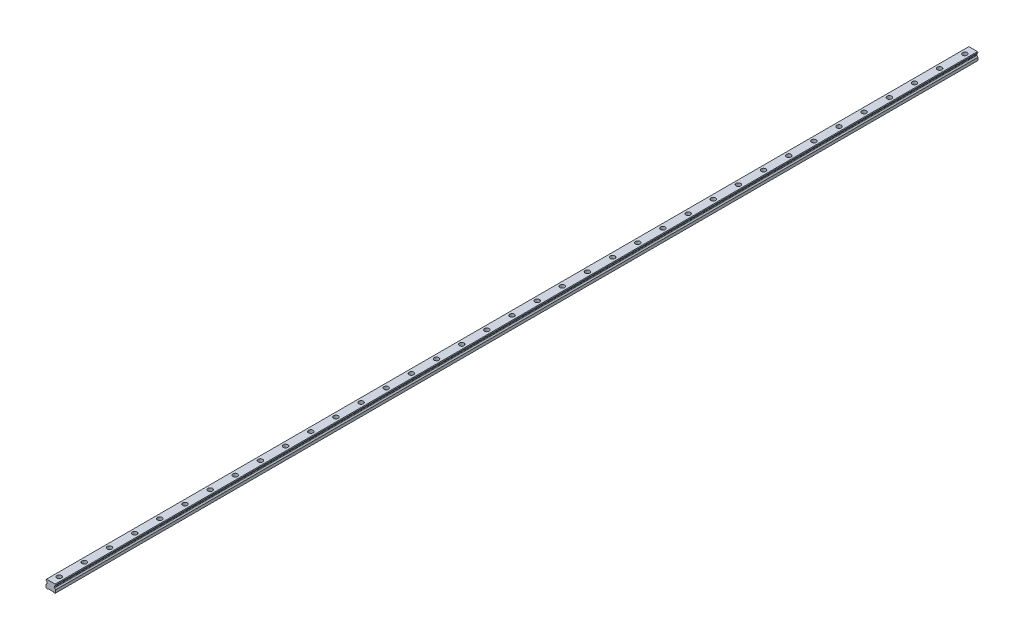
from build123d import *

# Parameters (mm, degrees)
SKETCH1_W           = 23
SKETCH1_H           = 19.2
BOSS_EXTRUDE1_DEPTH = 1100
CUT_EXTRUDE1_DEPTH  = 2201.113835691
CHAMFER1_SIZE       = 1.25
FILLET1_R           = 1.25
CUT_EXTRUDE2_DEPTH  = 2201.113835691
SKETCH4_R           = 5.5
SKETCH4_R_2         = 3.5
CUT_EXTRUDE3_DEPTH  = 9
SKETCH4_2_R         = 3.5
CUT_EXTRUDE4_DEPTH  = 1101.227653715
LPATTERN1_COUNT     = 37
LPATTERN1_PITCH     = 60


with BuildPart() as part:
    # Sketch1 → Boss-Extrude1 (new, symmetric)
    with BuildSketch(Plane.XY):
        with Locations((0, 9.6)):
            Rectangle(SKETCH1_W, SKETCH1_H)
    extrude(amount=BOSS_EXTRUDE1_DEPTH, both=True)

    # Sketch2 → Cut-Extrude1 (cut, through all)
    with BuildSketch(Plane.XY.offset(1100)):
        Polygon((-11.5, 16.7), (-11.5, 7.95), (-8.583333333, 10.866666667), (-8.583333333, 13.783333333), align=None)
        Polygon((8.583333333, 13.783333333), (11.5, 16.7), (11.5, 7.95), (8.583333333, 10.866666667), align=None)
    extrude(amount=-CUT_EXTRUDE1_DEPTH, mode=Mode.SUBTRACT)

    # Chamfer1
    chamfer1_edges = [part.edges().sort_by_distance(p)[0] for p in [
        (-11.5, 19.2, 0),
        (11.5, 19.2, 0),
        (11.5, 0, 0),
        (-11.5, 0, 0),
    ]]
    chamfer(chamfer1_edges, length=CHAMFER1_SIZE)

    # Fillet1
    fillet1_edges = [part.edges().sort_by_distance(p)[0] for p in [
        (-8.583333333, 13.783333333, 0),
        (-8.583333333, 10.866666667, 0),
        (8.583333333, 10.866666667, 0),
        (8.583333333, 13.783333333, 0),
    ]]
    fillet(fillet1_edges, radius=FILLET1_R)

    # Sketch3 → Cut-Extrude2 (cut, through all)
    with BuildSketch(Plane.XY.offset(1100)):
        Polygon((-7, 0), (-5.75, 1.25), (5.75, 1.25), (7, 0), align=None)
    extrude(amount=-CUT_EXTRUDE2_DEPTH, mode=Mode.SUBTRACT)

    # Sketch4 → Cut-Extrude3 (cut)
    with BuildSketch(Plane(origin=(0, 19.2, 0), x_dir=(1, 0, 0), z_dir=(0, 1, 0))):
        with Locations(Location((0, -1080, 0), (0, 0, 270))):
            Circle(SKETCH4_R)
        with Locations(Location((0, -1080, 0), (0, 0, 270))):
            Circle(SKETCH4_R_2, mode=Mode.SUBTRACT)
    cut_extrude3 = extrude(amount=-CUT_EXTRUDE3_DEPTH, mode=Mode.SUBTRACT)

    # Sketch4_2 → Cut-Extrude4 (cut, through all)
    with BuildSketch(Plane(origin=(0, 19.2, 0), x_dir=(1, 0, 0), z_dir=(0, 1, 0))):
        with Locations(Location((0, -1080, 0), (0, 0, 270))):
            Circle(SKETCH4_2_R)
    cut_extrude4 = extrude(amount=-CUT_EXTRUDE4_DEPTH, mode=Mode.SUBTRACT)

    # LPattern1: Cut-Extrude3, Cut-Extrude4 ×37
    with Locations(*[(0, 0, -i * LPATTERN1_PITCH) for i in range(1, LPATTERN1_COUNT)]):
        add(cut_extrude3, mode=Mode.SUBTRACT)
        add(cut_extrude4, mode=Mode.SUBTRACT)


solid = part.part
